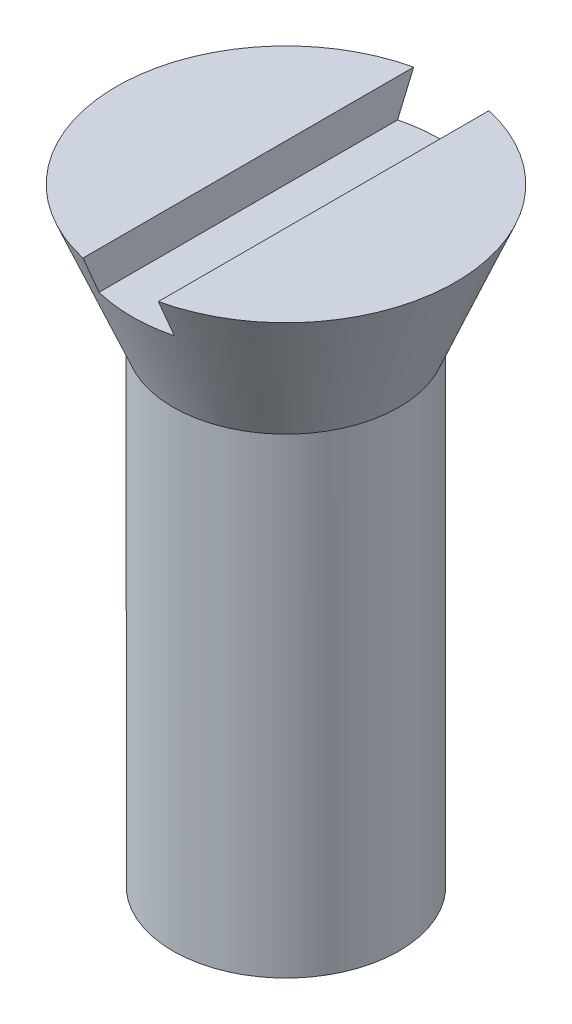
from build123d import *

# Parameters (mm, degrees)
SKETCH2_W      = 2
SKETCH2_H      = 13.914458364
EXTRUDE1_DEPTH = 1


with BuildPart() as part:
    # Sketch1 → Revolve1 (revolve)
    with BuildSketch(Plane.XY, mode=Mode.PRIVATE) as revolve1_sk:
        Polygon((0, 0), (-3, 1.732050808), (-3, 14.232050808), (-4.5, 17.853371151), (0, 17.853371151), align=None)
    revolve(revolve1_sk.sketch.rotate(Axis((0, 0, 0), (0, 1, 0)), 270), axis=Axis((0, 0, 0), (0, 1, 0)))

    # Sketch2 → Extrude1 (cut)
    with BuildSketch(Plane(origin=(0, 17.853371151, 0), x_dir=(1, 0, 0), z_dir=(0, 1, 0))):
        Rectangle(SKETCH2_W, SKETCH2_H)
    extrude(amount=-EXTRUDE1_DEPTH, mode=Mode.SUBTRACT)


solid = part.part
